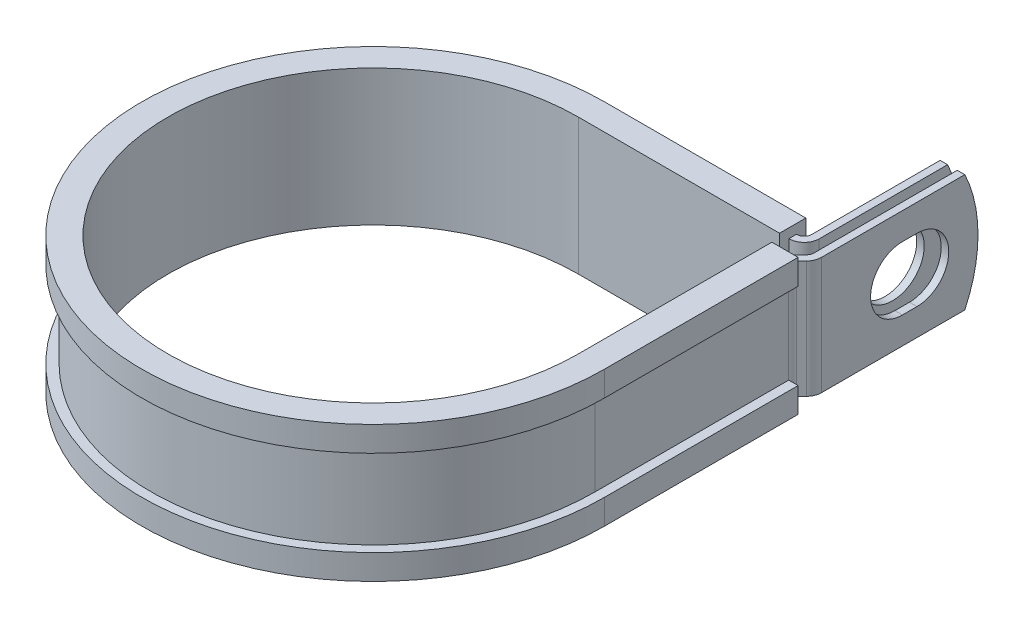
from build123d import *

# Parameters (mm, degrees)
EXTRUDE_THIN1_DEPTH = 9.525
SKETCH2_R           = 5.1562
CUT_EXTRUDE1_DEPTH  = 1.2192
CUT_EXTRUDE2_DEPTH  = 1.2192
CUT_EXTRUDE3_DEPTH  = 93.914817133


with BuildPart() as part:
    # Sketch1 → Extrude-Thin1 (new, symmetric)
    with BuildSketch(Plane(origin=(0, 0, 0), x_dir=(1, 0, 0), z_dir=(0, 1, 0))):
        with BuildLine():
            Line((36.7589698, 60.2996), (36.7589698, 34.8615))
            ThreePointArc((36.7589698, 34.8615), (36.666163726, 34.394932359), (36.401874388, 33.999395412))
            Line((36.401874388, 33.999395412), (35.575690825, 33.173211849))
            ThreePointArc((35.575690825, 33.173211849), (35.047112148, 32.382137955), (34.8615, 31.449002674))
            Line((34.8615, 31.449002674), (34.8615, 0))
            ThreePointArc((34.8615, 0), (-24.650803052, -24.650803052), (0, 34.8615))
            Line((0, 34.8615), (32.7457698, 34.8615))
            ThreePointArc((32.7457698, 34.8615), (34.469978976, 35.575690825), (35.1841698, 37.2999))
            Line((35.1841698, 37.2999), (35.1841698, 60.2996))
            Line((35.1841698, 60.2996), (33.9649698, 60.2996))
            Line((33.9649698, 60.2996), (33.9649698, 37.2999))
            ThreePointArc((33.9649698, 37.2999), (33.607874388, 36.437795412), (32.7457698, 36.0807))
            Line((32.7457698, 36.0807), (0, 36.0807))
            ThreePointArc((0, 36.0807), (-25.51290764, -25.51290764), (36.0807, 0))
            Line((36.0807, 0), (36.0807, 31.449002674))
            ThreePointArc((36.0807, 31.449002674), (36.173506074, 31.915570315), (36.437795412, 32.311107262))
            Line((36.437795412, 32.311107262), (37.263978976, 33.137290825))
            ThreePointArc((37.263978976, 33.137290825), (37.792557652, 33.928364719), (37.9781698, 34.8615))
            Line((37.9781698, 34.8615), (37.9781698, 60.2996))
            Line((37.9781698, 60.2996), (36.7589698, 60.2996))
        make_face()
    extrude(amount=EXTRUDE_THIN1_DEPTH, both=True)

    # Sketch2 → Cut-Extrude1 (cut)
    with BuildSketch(Plane.ZY.offset(-33.9649698)):
        with Locations((-49.1998, 0)):
            Circle(SKETCH2_R)
    extrude(amount=-CUT_EXTRUDE1_DEPTH, mode=Mode.SUBTRACT)

    # Sketch3 → Cut-Extrude2 (cut)
    with BuildSketch(Plane(origin=(37.9781698, 0, 0), x_dir=(0, 0, -1), z_dir=(1, 0, 0))):
        with BuildLine():
            Line((48.006, 5.1562), (50.3936, 5.1562))
            ThreePointArc((50.3936, 5.1562), (55.5498, 0), (50.3936, -5.1562))
            Line((50.3936, -5.1562), (48.006, -5.1562))
            ThreePointArc((48.006, -5.1562), (42.8498, 0), (48.006, 5.1562))
        make_face()
    extrude(amount=-CUT_EXTRUDE2_DEPTH, mode=Mode.SUBTRACT)

    # Sketch4 → Cut-Extrude3 (cut, through all)
    with BuildSketch(Plane.ZY.offset(-33.9649698)):
        with BuildLine():
            Line((-58.155063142, 9.525), (-60.2996, 9.525))
            Line((-60.2996, 9.525), (-60.2996, -2e-09))
            ThreePointArc((-60.2996, -2e-09), (-59.756838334, 4.881717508), (-58.155063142, 9.525))
        make_face()
        with BuildLine():
            ThreePointArc((-58.155063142, -9.525), (-59.756838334, -4.88171751), (-60.2996, -2e-09))
            Line((-60.2996, -2e-09), (-60.2996, -9.525))
            Line((-60.2996, -9.525), (-58.155063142, -9.525))
        make_face()
    extrude(amount=-CUT_EXTRUDE3_DEPTH, mode=Mode.SUBTRACT)

    # Sweep1: sweep along a path in Sketch6
    with BuildLine(Plane(origin=(0, 9.525, 0), x_dir=(1, 0, 0), z_dir=(0, 1, 0))) as sweep1_path:
        Line((33.3375, 31.449002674), (33.3375, 0))
        ThreePointArc((33.3375, 0), (-23.573172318, -23.573172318), (0, 33.3375))
        Line((0, 33.3375), (32.6949698, 33.3375))
    # Sketch5 → Sweep1 (sweep)
    with BuildSketch(Plane(origin=(0, 0, -31.449002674), x_dir=(-1, 0, 0), z_dir=(0, 0, -1))):
        Polygon((-36.0807, 9.525), (-34.8615, 9.525), (-34.8615, -9.525), (-36.0807, -9.525), (-36.0807, -6.985), (-37.6047, -6.985), (-37.6047, -11.049), (-33.3375, -11.049), (-33.3375, 11.049), (-37.6047, 11.049), (-37.6047, 6.985), (-36.0807, 6.985), align=None)
    sweep(path=sweep1_path.line)


solid = part.part
